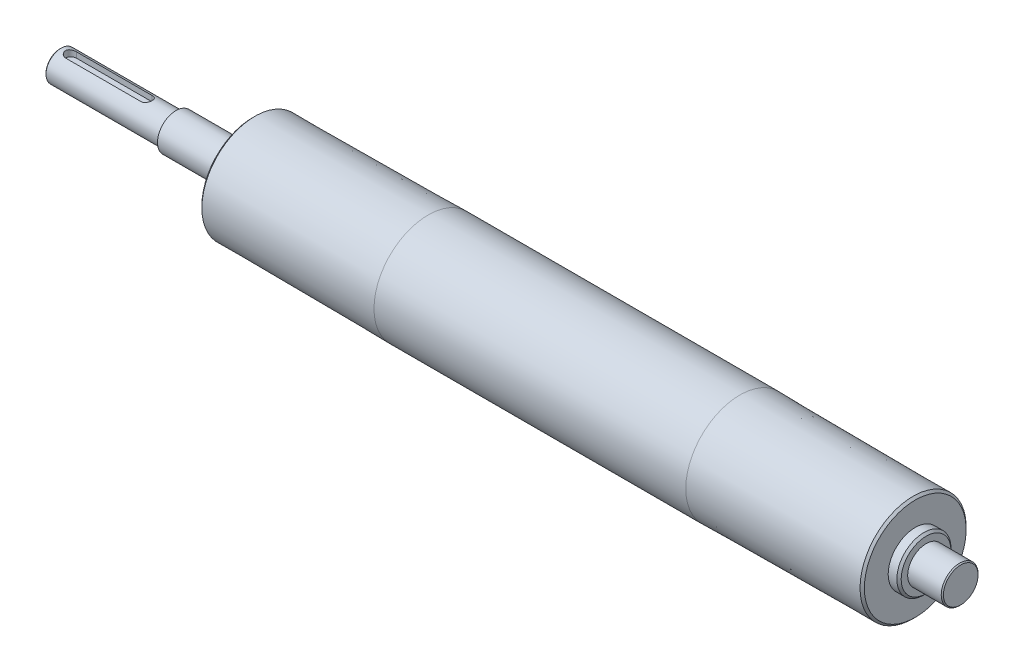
ISO-10303-21;
HEADER;
FILE_DESCRIPTION(('STEP AP214'),'2;1');
FILE_NAME('part.step','',(''),(''),'','','');
FILE_SCHEMA(('AUTOMOTIVE_DESIGN { 1 0 10303 214 1 1 1 1 }'));
ENDSEC;
DATA;
#1=APPLICATION_CONTEXT('core data for automotive mechanical design processes');
#2=APPLICATION_PROTOCOL_DEFINITION('international standard','automotive_design',2000,#1);
#3=PRODUCT_CONTEXT('',#1,'mechanical');
#4=PRODUCT('Part','Part','',(#3));
#5=PRODUCT_RELATED_PRODUCT_CATEGORY('part','',(#4));
#6=PRODUCT_DEFINITION_FORMATION('','',#4);
#7=PRODUCT_DEFINITION_CONTEXT('part definition',#1,'design');
#8=PRODUCT_DEFINITION('design','',#6,#7);
#9=PRODUCT_DEFINITION_SHAPE('','',#8);
#10=(LENGTH_UNIT() NAMED_UNIT(*) SI_UNIT(.MILLI.,.METRE.));
#11=(NAMED_UNIT(*) PLANE_ANGLE_UNIT() SI_UNIT($,.RADIAN.));
#12=(NAMED_UNIT(*) SI_UNIT($,.STERADIAN.) SOLID_ANGLE_UNIT());
#13=UNCERTAINTY_MEASURE_WITH_UNIT(LENGTH_MEASURE(1.E-05),#10,'distance_accuracy_value','');
#14=(GEOMETRIC_REPRESENTATION_CONTEXT(3) GLOBAL_UNCERTAINTY_ASSIGNED_CONTEXT((#13)) GLOBAL_UNIT_ASSIGNED_CONTEXT((#10,
#11,#12)) REPRESENTATION_CONTEXT('',''));
#15=CARTESIAN_POINT('',(0.,0.,0.));
#16=DIRECTION('',(0.,0.,1.));
#17=DIRECTION('',(1.,0.,0.));
#18=AXIS2_PLACEMENT_3D('',#15,#16,#17);
#19=CARTESIAN_POINT('',(-72.,0.,0.));
#20=DIRECTION('',(1.,0.,0.));
#21=DIRECTION('',(0.,0.,-1.));
#22=AXIS2_PLACEMENT_3D('',#19,#20,#21);
#23=CONICAL_SURFACE('',#22,25.,0.00624991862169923);
#24=CARTESIAN_POINT('',(-152.,0.,0.));
#25=DIRECTION('',(-1.,0.,0.));
#26=DIRECTION('',(0.,0.,1.));
#27=AXIS2_PLACEMENT_3D('',#24,#25,#26);
#28=CIRCLE('',#27,24.5);
#29=CARTESIAN_POINT('',(-152.,0.,24.5));
#30=VERTEX_POINT('',#29);
#31=EDGE_CURVE('E160',#30,#30,#28,.T.);
#32=ORIENTED_EDGE('',*,*,#31,.F.);
#33=EDGE_LOOP('',(#32));
#34=FACE_BOUND('',#33,.T.);
#35=CARTESIAN_POINT('',(-72.,0.,0.));
#36=DIRECTION('',(-1.,0.,0.));
#37=DIRECTION('',(0.,0.,1.));
#38=AXIS2_PLACEMENT_3D('',#35,#36,#37);
#39=CIRCLE('',#38,25.);
#40=CARTESIAN_POINT('',(-72.,0.,25.0000000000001));
#41=VERTEX_POINT('',#40);
#42=EDGE_CURVE('E94',#41,#41,#39,.T.);
#43=ORIENTED_EDGE('',*,*,#42,.T.);
#44=EDGE_LOOP('',(#43));
#45=FACE_BOUND('',#44,.T.);
#46=ADVANCED_FACE('F30',(#34,#45),#23,.T.);
#47=CARTESIAN_POINT('',(-152.,0.,0.));
#48=DIRECTION('',(1.,0.,0.));
#49=DIRECTION('',(0.,0.,-1.));
#50=AXIS2_PLACEMENT_3D('',#47,#48,#49);
#51=CONICAL_SURFACE('',#50,24.5,0.785398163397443);
#52=CARTESIAN_POINT('',(-153.,0.,0.));
#53=DIRECTION('',(-1.,0.,0.));
#54=DIRECTION('',(0.,0.,1.));
#55=AXIS2_PLACEMENT_3D('',#52,#53,#54);
#56=CIRCLE('',#55,23.5);
#57=CARTESIAN_POINT('',(-153.,0.,23.5000000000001));
#58=VERTEX_POINT('',#57);
#59=EDGE_CURVE('E157',#58,#58,#56,.T.);
#60=ORIENTED_EDGE('',*,*,#59,.F.);
#61=EDGE_LOOP('',(#60));
#62=FACE_BOUND('',#61,.T.);
#63=ORIENTED_EDGE('',*,*,#31,.T.);
#64=EDGE_LOOP('',(#63));
#65=FACE_BOUND('',#64,.T.);
#66=ADVANCED_FACE('F253',(#62,#65),#51,.T.);
#67=CARTESIAN_POINT('',(-153.,0.,-23.5));
#68=DIRECTION('',(1.,0.,0.));
#69=DIRECTION('',(0.,0.,-1.));
#70=AXIS2_PLACEMENT_3D('',#67,#68,#69);
#71=PLANE('',#70);
#72=CARTESIAN_POINT('',(-153.,0.,0.));
#73=DIRECTION('',(-1.,0.,0.));
#74=DIRECTION('',(0.,0.,1.));
#75=AXIS2_PLACEMENT_3D('',#72,#73,#74);
#76=CIRCLE('',#75,12.5);
#77=CARTESIAN_POINT('',(-153.,0.,12.5000000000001));
#78=VERTEX_POINT('',#77);
#79=EDGE_CURVE('E154',#78,#78,#76,.T.);
#80=ORIENTED_EDGE('',*,*,#79,.F.);
#81=EDGE_LOOP('',(#80));
#82=FACE_BOUND('',#81,.T.);
#83=ORIENTED_EDGE('',*,*,#59,.T.);
#84=EDGE_LOOP('',(#83));
#85=FACE_BOUND('',#84,.T.);
#86=ADVANCED_FACE('F258',(#82,#85),#71,.F.);
#87=CARTESIAN_POINT('',(-226.,0.,0.));
#88=DIRECTION('',(-1.,0.,0.));
#89=DIRECTION('',(0.,0.,1.));
#90=AXIS2_PLACEMENT_3D('',#87,#88,#89);
#91=CYLINDRICAL_SURFACE('',#90,12.5);
#92=CARTESIAN_POINT('',(-157.,0.,0.));
#93=DIRECTION('',(-1.,0.,0.));
#94=DIRECTION('',(0.,0.,1.));
#95=AXIS2_PLACEMENT_3D('',#92,#93,#94);
#96=CIRCLE('',#95,12.5);
#97=CARTESIAN_POINT('',(-157.,0.,12.5000000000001));
#98=VERTEX_POINT('',#97);
#99=EDGE_CURVE('E151',#98,#98,#96,.T.);
#100=ORIENTED_EDGE('',*,*,#99,.F.);
#101=EDGE_LOOP('',(#100));
#102=FACE_BOUND('',#101,.T.);
#103=ORIENTED_EDGE('',*,*,#79,.T.);
#104=EDGE_LOOP('',(#103));
#105=FACE_BOUND('',#104,.T.);
#106=ADVANCED_FACE('F285',(#102,#105),#91,.T.);
#107=CARTESIAN_POINT('',(-157.,0.,0.));
#108=DIRECTION('',(1.,0.,0.));
#109=DIRECTION('',(0.,0.,-1.));
#110=AXIS2_PLACEMENT_3D('',#107,#108,#109);
#111=CONICAL_SURFACE('',#110,12.5,0.785398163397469);
#112=CARTESIAN_POINT('',(-158.,0.,0.));
#113=DIRECTION('',(-1.,0.,0.));
#114=DIRECTION('',(0.,0.,1.));
#115=AXIS2_PLACEMENT_3D('',#112,#113,#114);
#116=CIRCLE('',#115,11.5);
#117=CARTESIAN_POINT('',(-158.,0.,11.5));
#118=VERTEX_POINT('',#117);
#119=EDGE_CURVE('E148',#118,#118,#116,.T.);
#120=ORIENTED_EDGE('',*,*,#119,.F.);
#121=EDGE_LOOP('',(#120));
#122=FACE_BOUND('',#121,.T.);
#123=ORIENTED_EDGE('',*,*,#99,.T.);
#124=EDGE_LOOP('',(#123));
#125=FACE_BOUND('',#124,.T.);
#126=ADVANCED_FACE('F292',(#122,#125),#111,.T.);
#127=CARTESIAN_POINT('',(-158.,0.,-11.4999999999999));
#128=DIRECTION('',(1.,0.,0.));
#129=DIRECTION('',(0.,0.,-1.));
#130=AXIS2_PLACEMENT_3D('',#127,#128,#129);
#131=PLANE('',#130);
#132=CARTESIAN_POINT('',(-158.,0.,0.));
#133=DIRECTION('',(-1.,0.,0.));
#134=DIRECTION('',(0.,0.,1.));
#135=AXIS2_PLACEMENT_3D('',#132,#133,#134);
#136=CIRCLE('',#135,8.50000000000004);
#137=CARTESIAN_POINT('',(-158.,0.,8.50000000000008));
#138=VERTEX_POINT('',#137);
#139=EDGE_CURVE('E145',#138,#138,#136,.T.);
#140=ORIENTED_EDGE('',*,*,#139,.F.);
#141=EDGE_LOOP('',(#140));
#142=FACE_BOUND('',#141,.T.);
#143=ORIENTED_EDGE('',*,*,#119,.T.);
#144=EDGE_LOOP('',(#143));
#145=FACE_BOUND('',#144,.T.);
#146=ADVANCED_FACE('F296',(#142,#145),#131,.F.);
#147=CARTESIAN_POINT('',(-226.,0.,0.));
#148=DIRECTION('',(-1.,0.,0.));
#149=DIRECTION('',(0.,0.,1.));
#150=AXIS2_PLACEMENT_3D('',#147,#148,#149);
#151=CYLINDRICAL_SURFACE('',#150,8.50000000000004);
#152=CARTESIAN_POINT('',(-188.5,0.,0.));
#153=DIRECTION('',(-1.,0.,0.));
#154=DIRECTION('',(0.,0.,1.));
#155=AXIS2_PLACEMENT_3D('',#152,#153,#154);
#156=CIRCLE('',#155,8.50000000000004);
#157=CARTESIAN_POINT('',(-188.5,0.,8.50000000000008));
#158=VERTEX_POINT('',#157);
#159=EDGE_CURVE('E142',#158,#158,#156,.T.);
#160=ORIENTED_EDGE('',*,*,#159,.F.);
#161=EDGE_LOOP('',(#160));
#162=FACE_BOUND('',#161,.T.);
#163=ORIENTED_EDGE('',*,*,#139,.T.);
#164=EDGE_LOOP('',(#163));
#165=FACE_BOUND('',#164,.T.);
#166=ADVANCED_FACE('F300',(#162,#165),#151,.T.);
#167=CARTESIAN_POINT('',(-188.5,0.,-8.5));
#168=DIRECTION('',(1.,0.,0.));
#169=DIRECTION('',(0.,0.,-1.));
#170=AXIS2_PLACEMENT_3D('',#167,#168,#169);
#171=PLANE('',#170);
#172=CARTESIAN_POINT('',(-188.5,0.,0.));
#173=DIRECTION('',(-1.,0.,0.));
#174=DIRECTION('',(0.,0.,1.));
#175=AXIS2_PLACEMENT_3D('',#172,#173,#174);
#176=CIRCLE('',#175,7.00000000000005);
#177=CARTESIAN_POINT('',(-188.5,0.,7.00000000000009));
#178=VERTEX_POINT('',#177);
#179=EDGE_CURVE('E139',#178,#178,#176,.T.);
#180=ORIENTED_EDGE('',*,*,#179,.F.);
#181=EDGE_LOOP('',(#180));
#182=FACE_BOUND('',#181,.T.);
#183=ORIENTED_EDGE('',*,*,#159,.T.);
#184=EDGE_LOOP('',(#183));
#185=FACE_BOUND('',#184,.T.);
#186=ADVANCED_FACE('F248',(#182,#185),#171,.F.);
#187=CARTESIAN_POINT('',(-226.,0.,0.));
#188=DIRECTION('',(-1.,0.,0.));
#189=DIRECTION('',(0.,0.,1.));
#190=AXIS2_PLACEMENT_3D('',#187,#188,#189);
#191=CYLINDRICAL_SURFACE('',#190,7.00000000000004);
#192=DIRECTION('',(-1.,0.,0.));
#193=VECTOR('',#192,1.);
#194=CARTESIAN_POINT('',(-226.,6.53834841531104,2.50000000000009));
#195=LINE('',#194,#193);
#196=CARTESIAN_POINT('',(-237.,6.53834841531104,2.50000000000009));
#197=VERTEX_POINT('',#196);
#198=CARTESIAN_POINT('',(-202.,6.53834841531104,2.50000000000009));
#199=VERTEX_POINT('',#198);
#200=EDGE_CURVE('E11',#197,#199,#195,.F.);
#201=ORIENTED_EDGE('',*,*,#200,.F.);
#202=CARTESIAN_POINT('',(-237.,6.53834841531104,2.50000000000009));
#203=CARTESIAN_POINT('',(-237.067889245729,6.53833653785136,2.50000932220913));
#204=CARTESIAN_POINT('',(-237.135771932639,6.53940549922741,2.49723485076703));
#205=CARTESIAN_POINT('',(-237.271003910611,6.54361657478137,2.48619102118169));
#206=CARTESIAN_POINT('',(-237.338353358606,6.54675805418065,2.47792334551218));
#207=CARTESIAN_POINT('',(-237.471821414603,6.55501217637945,2.45600175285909));
#208=CARTESIAN_POINT('',(-237.53794333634,6.56011831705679,2.44236559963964));
#209=CARTESIAN_POINT('',(-237.668701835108,6.57213177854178,2.40985115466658));
#210=CARTESIAN_POINT('',(-237.733338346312,6.57903917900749,2.39097263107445));
#211=CARTESIAN_POINT('',(-237.924264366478,6.60214934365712,2.32673964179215));
#212=CARTESIAN_POINT('',(-238.047790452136,6.62075475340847,2.27375112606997));
#213=CARTESIAN_POINT('',(-238.284230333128,6.66225397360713,2.14910757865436));
#214=CARTESIAN_POINT('',(-238.397136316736,6.68515090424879,2.07743895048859));
#215=CARTESIAN_POINT('',(-238.614215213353,6.73379913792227,1.91402571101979));
#216=CARTESIAN_POINT('',(-238.717846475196,6.75962864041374,1.82158337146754));
#217=CARTESIAN_POINT('',(-238.908508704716,6.81057592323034,1.62073388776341));
#218=CARTESIAN_POINT('',(-238.995536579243,6.83569357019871,1.51232377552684));
#219=CARTESIAN_POINT('',(-239.153089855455,6.88331133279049,1.27853915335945));
#220=CARTESIAN_POINT('',(-239.223031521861,6.905708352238,1.15274833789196));
#221=CARTESIAN_POINT('',(-239.340536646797,6.94442357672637,0.890250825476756));
#222=CARTESIAN_POINT('',(-239.388107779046,6.96074386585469,0.753547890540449));
#223=CARTESIAN_POINT('',(-239.457640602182,6.98491050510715,0.478829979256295));
#224=CARTESIAN_POINT('',(-239.480539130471,6.99306594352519,0.341079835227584));
#225=CARTESIAN_POINT('',(-239.503068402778,7.00108798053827,0.0634643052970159));
#226=CARTESIAN_POINT('',(-239.502705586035,7.00095687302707,-0.0764004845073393));
#227=CARTESIAN_POINT('',(-239.479288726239,6.99262258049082,-0.34759325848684));
#228=CARTESIAN_POINT('',(-239.457255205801,6.98478243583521,-0.479022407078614));
#229=CARTESIAN_POINT('',(-239.392826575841,6.96237832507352,-0.736175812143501));
#230=CARTESIAN_POINT('',(-239.350430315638,6.94781397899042,-0.861899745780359));
#231=CARTESIAN_POINT('',(-239.245953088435,6.91316506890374,-1.10616102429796));
#232=CARTESIAN_POINT('',(-239.18360428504,6.8930059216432,-1.22457279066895));
#233=CARTESIAN_POINT('',(-239.041220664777,6.84923355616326,-1.44953531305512));
#234=CARTESIAN_POINT('',(-238.961180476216,6.82561928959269,-1.55608245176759));
#235=CARTESIAN_POINT('',(-238.780676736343,6.77590547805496,-1.76032445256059));
#236=CARTESIAN_POINT('',(-238.679350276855,6.74974055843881,-1.85724185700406));
#237=CARTESIAN_POINT('',(-238.461672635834,6.69890342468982,-2.03299914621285));
#238=CARTESIAN_POINT('',(-238.345316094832,6.67423174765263,-2.11183255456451));
#239=CARTESIAN_POINT('',(-238.098057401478,6.62877803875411,-2.25049860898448));
#240=CARTESIAN_POINT('',(-237.966921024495,6.60807875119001,-2.30994207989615));
#241=CARTESIAN_POINT('',(-237.695635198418,6.57388213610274,-2.40555439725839));
#242=CARTESIAN_POINT('',(-237.555500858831,6.5603730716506,-2.44176119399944));
#243=CARTESIAN_POINT('',(-237.344969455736,6.54708542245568,-2.47705497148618));
#244=CARTESIAN_POINT('',(-237.276263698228,6.54382010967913,-2.48565347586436));
#245=CARTESIAN_POINT('',(-237.138384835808,6.53944910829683,-2.49712352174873));
#246=CARTESIAN_POINT('',(-237.0692123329,6.53834103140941,-2.50000139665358));
#247=CARTESIAN_POINT('',(-237.,6.53834841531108,-2.49999999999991));
#248=B_SPLINE_CURVE_WITH_KNOTS('',3,(#202,#203,#204,#205,#206,#207,#208,#209,#210,#211,#212,
#213,#214,#215,#216,#217,#218,#219,#220,#221,#222,#223,#224,#225,#226,#227,#228,#229,#230,#231,
#232,#233,#234,#235,#236,#237,#238,#239,#240,#241,#242,#243,#244,#245,#246,#247),.UNSPECIFIED.,
.F.,.F.,(4,2,2,2,2,2,2,2,2,2,2,2,2,2,2,2,2,2,2,2,2,2,4),(0.,0.203591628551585,0.407120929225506,
0.609982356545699,0.812852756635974,1.21793118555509,1.62330528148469,2.04515972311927,
2.46709267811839,2.90188398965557,3.33652604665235,3.75400993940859,4.17137826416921,
4.56998920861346,4.96862268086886,5.37284909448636,5.7771984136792,6.20315837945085,
6.62927065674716,7.06347329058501,7.49696496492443,7.70468580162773,7.91217653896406),.UNSPECIFIED.);
#249=CARTESIAN_POINT('',(-237.,6.53834841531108,-2.49999999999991));
#250=VERTEX_POINT('',#249);
#251=EDGE_CURVE('E163',#197,#250,#248,.T.);
#252=ORIENTED_EDGE('',*,*,#251,.T.);
#253=DIRECTION('',(-1.,0.,0.));
#254=VECTOR('',#253,1.);
#255=CARTESIAN_POINT('',(-226.,6.53834841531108,-2.49999999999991));
#256=LINE('',#255,#254);
#257=CARTESIAN_POINT('',(-202.,6.53834841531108,-2.49999999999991));
#258=VERTEX_POINT('',#257);
#259=EDGE_CURVE('E37',#250,#258,#256,.F.);
#260=ORIENTED_EDGE('',*,*,#259,.T.);
#261=CARTESIAN_POINT('',(-202.,6.53834841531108,-2.49999999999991));
#262=CARTESIAN_POINT('',(-201.932110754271,6.53833653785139,-2.50000932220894));
#263=CARTESIAN_POINT('',(-201.864228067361,6.53940549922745,-2.49723485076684));
#264=CARTESIAN_POINT('',(-201.728996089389,6.5436165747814,-2.4861910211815));
#265=CARTESIAN_POINT('',(-201.661646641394,6.54675805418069,-2.47792334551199));
#266=CARTESIAN_POINT('',(-201.528178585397,6.55501217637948,-2.4560017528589));
#267=CARTESIAN_POINT('',(-201.46205666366,6.56011831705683,-2.44236559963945));
#268=CARTESIAN_POINT('',(-201.331298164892,6.57213177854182,-2.40985115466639));
#269=CARTESIAN_POINT('',(-201.266661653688,6.57903917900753,-2.39097263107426));
#270=CARTESIAN_POINT('',(-201.075735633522,6.60214934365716,-2.32673964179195));
#271=CARTESIAN_POINT('',(-200.952209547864,6.62075475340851,-2.27375112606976));
#272=CARTESIAN_POINT('',(-200.715769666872,6.66225397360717,-2.14910757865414));
#273=CARTESIAN_POINT('',(-200.602863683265,6.68515090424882,-2.07743895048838));
#274=CARTESIAN_POINT('',(-200.385784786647,6.7337991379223,-1.91402571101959));
#275=CARTESIAN_POINT('',(-200.282153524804,6.75962864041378,-1.82158337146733));
#276=CARTESIAN_POINT('',(-200.091491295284,6.81057592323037,-1.6207338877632));
#277=CARTESIAN_POINT('',(-200.004463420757,6.83569357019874,-1.51232377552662));
#278=CARTESIAN_POINT('',(-199.846910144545,6.88331133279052,-1.27853915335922));
#279=CARTESIAN_POINT('',(-199.77696847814,6.90570835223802,-1.15274833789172));
#280=CARTESIAN_POINT('',(-199.659463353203,6.94442357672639,-0.890250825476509));
#281=CARTESIAN_POINT('',(-199.611892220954,6.96074386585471,-0.753547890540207));
#282=CARTESIAN_POINT('',(-199.542359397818,6.98491050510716,-0.478829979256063));
#283=CARTESIAN_POINT('',(-199.519460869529,6.9930659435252,-0.341079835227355));
#284=CARTESIAN_POINT('',(-199.496931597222,7.00108798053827,-0.063464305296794));
#285=CARTESIAN_POINT('',(-199.497294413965,7.00095687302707,0.0764004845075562));
#286=CARTESIAN_POINT('',(-199.520711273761,6.99262258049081,0.347593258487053));
#287=CARTESIAN_POINT('',(-199.542744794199,6.9847824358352,0.479022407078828));
#288=CARTESIAN_POINT('',(-199.607173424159,6.96237832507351,0.736175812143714));
#289=CARTESIAN_POINT('',(-199.649569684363,6.94781397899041,0.861899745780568));
#290=CARTESIAN_POINT('',(-199.754046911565,6.91316506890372,1.10616102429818));
#291=CARTESIAN_POINT('',(-199.81639571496,6.89300592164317,1.22457279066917));
#292=CARTESIAN_POINT('',(-199.958779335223,6.84923355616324,1.44953531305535));
#293=CARTESIAN_POINT('',(-200.038819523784,6.82561928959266,1.55608245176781));
#294=CARTESIAN_POINT('',(-200.219323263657,6.77590547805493,1.76032445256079));
#295=CARTESIAN_POINT('',(-200.320649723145,6.74974055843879,1.85724185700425));
#296=CARTESIAN_POINT('',(-200.538327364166,6.69890342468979,2.03299914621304));
#297=CARTESIAN_POINT('',(-200.654683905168,6.6742317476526,2.11183255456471));
#298=CARTESIAN_POINT('',(-200.901942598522,6.62877803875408,2.25049860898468));
#299=CARTESIAN_POINT('',(-201.033078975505,6.60807875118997,2.30994207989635));
#300=CARTESIAN_POINT('',(-201.304364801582,6.5738821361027,2.40555439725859));
#301=CARTESIAN_POINT('',(-201.444499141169,6.56037307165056,2.44176119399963));
#302=CARTESIAN_POINT('',(-201.655030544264,6.54708542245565,2.47705497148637));
#303=CARTESIAN_POINT('',(-201.723736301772,6.5438201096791,2.48565347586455));
#304=CARTESIAN_POINT('',(-201.861615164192,6.53944910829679,2.49712352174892));
#305=CARTESIAN_POINT('',(-201.930787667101,6.53834103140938,2.50000139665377));
#306=CARTESIAN_POINT('',(-202.,6.53834841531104,2.50000000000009));
#307=B_SPLINE_CURVE_WITH_KNOTS('',3,(#261,#262,#263,#264,#265,#266,#267,#268,#269,#270,#271,
#272,#273,#274,#275,#276,#277,#278,#279,#280,#281,#282,#283,#284,#285,#286,#287,#288,#289,#290,
#291,#292,#293,#294,#295,#296,#297,#298,#299,#300,#301,#302,#303,#304,#305,#306),.UNSPECIFIED.,
.F.,.F.,(4,2,2,2,2,2,2,2,2,2,2,2,2,2,2,2,2,2,2,2,2,2,4),(0.,0.203591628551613,0.407120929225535,
0.609982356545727,0.812852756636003,1.21793118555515,1.62330528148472,2.04515972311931,
2.46709267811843,2.90188398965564,3.33652604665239,3.75400993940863,4.17137826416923,
4.56998920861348,4.96862268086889,5.37284909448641,5.77719841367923,6.20315837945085,
6.62927065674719,7.06347329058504,7.49696496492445,7.70468580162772,7.91217653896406),.UNSPECIFIED.);
#308=EDGE_CURVE('E44',#258,#199,#307,.T.);
#309=ORIENTED_EDGE('',*,*,#308,.T.);
#310=EDGE_LOOP('',(#201,#252,#260,#309));
#311=FACE_BOUND('',#310,.T.);
#312=CARTESIAN_POINT('',(-241.5,0.,0.));
#313=DIRECTION('',(-1.,0.,0.));
#314=DIRECTION('',(0.,0.,1.));
#315=AXIS2_PLACEMENT_3D('',#312,#313,#314);
#316=CIRCLE('',#315,7.00000000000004);
#317=CARTESIAN_POINT('',(-241.5,0.,7.00000000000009));
#318=VERTEX_POINT('',#317);
#319=EDGE_CURVE('E136',#318,#318,#316,.T.);
#320=ORIENTED_EDGE('',*,*,#319,.F.);
#321=EDGE_LOOP('',(#320));
#322=FACE_BOUND('',#321,.T.);
#323=ORIENTED_EDGE('',*,*,#179,.T.);
#324=EDGE_LOOP('',(#323));
#325=FACE_BOUND('',#324,.T.);
#326=ADVANCED_FACE('F175',(#311,#322,#325),#191,.T.);
#327=CARTESIAN_POINT('',(-241.5,0.,0.));
#328=DIRECTION('',(1.,0.,0.));
#329=DIRECTION('',(0.,0.,-1.));
#330=AXIS2_PLACEMENT_3D('',#327,#328,#329);
#331=CONICAL_SURFACE('',#330,7.00000000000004,0.785398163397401);
#332=CARTESIAN_POINT('',(-242.,0.,0.));
#333=DIRECTION('',(-1.,0.,0.));
#334=DIRECTION('',(0.,0.,1.));
#335=AXIS2_PLACEMENT_3D('',#332,#333,#334);
#336=CIRCLE('',#335,6.50000000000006);
#337=CARTESIAN_POINT('',(-242.,0.,6.50000000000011));
#338=VERTEX_POINT('',#337);
#339=EDGE_CURVE('E133',#338,#338,#336,.T.);
#340=ORIENTED_EDGE('',*,*,#339,.F.);
#341=EDGE_LOOP('',(#340));
#342=FACE_BOUND('',#341,.T.);
#343=ORIENTED_EDGE('',*,*,#319,.T.);
#344=EDGE_LOOP('',(#343));
#345=FACE_BOUND('',#344,.T.);
#346=ADVANCED_FACE('F241',(#342,#345),#331,.T.);
#347=CARTESIAN_POINT('',(-242.,0.,-6.50000000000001));
#348=DIRECTION('',(1.,0.,0.));
#349=DIRECTION('',(0.,0.,-1.));
#350=AXIS2_PLACEMENT_3D('',#347,#348,#349);
#351=PLANE('',#350);
#352=CARTESIAN_POINT('',(-242.,0.,0.));
#353=DIRECTION('',(-1.,0.,0.));
#354=DIRECTION('',(0.,0.,1.));
#355=AXIS2_PLACEMENT_3D('',#352,#353,#354);
#356=CIRCLE('',#355,3.00000000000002);
#357=CARTESIAN_POINT('',(-242.,0.,3.00000000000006));
#358=VERTEX_POINT('',#357);
#359=EDGE_CURVE('E130',#358,#358,#356,.T.);
#360=ORIENTED_EDGE('',*,*,#359,.F.);
#361=EDGE_LOOP('',(#360));
#362=FACE_BOUND('',#361,.T.);
#363=ORIENTED_EDGE('',*,*,#339,.T.);
#364=EDGE_LOOP('',(#363));
#365=FACE_BOUND('',#364,.T.);
#366=ADVANCED_FACE('F238',(#362,#365),#351,.F.);
#367=CARTESIAN_POINT('',(-226.,0.,0.));
#368=DIRECTION('',(-1.,0.,0.));
#369=DIRECTION('',(0.,0.,1.));
#370=AXIS2_PLACEMENT_3D('',#367,#368,#369);
#371=CYLINDRICAL_SURFACE('',#370,3.00000000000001);
#372=CARTESIAN_POINT('',(-226.,0.,0.));
#373=DIRECTION('',(-1.,0.,0.));
#374=DIRECTION('',(0.,0.,1.));
#375=AXIS2_PLACEMENT_3D('',#372,#373,#374);
#376=CIRCLE('',#375,3.00000000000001);
#377=CARTESIAN_POINT('',(-226.,0.,3.00000000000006));
#378=VERTEX_POINT('',#377);
#379=EDGE_CURVE('E127',#378,#378,#376,.T.);
#380=ORIENTED_EDGE('',*,*,#379,.F.);
#381=EDGE_LOOP('',(#380));
#382=FACE_BOUND('',#381,.T.);
#383=ORIENTED_EDGE('',*,*,#359,.T.);
#384=EDGE_LOOP('',(#383));
#385=FACE_BOUND('',#384,.T.);
#386=ADVANCED_FACE('F234',(#382,#385),#371,.F.);
#387=CARTESIAN_POINT('',(-226.,0.,-2.99999999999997));
#388=DIRECTION('',(1.,0.,0.));
#389=DIRECTION('',(0.,0.,-1.));
#390=AXIS2_PLACEMENT_3D('',#387,#388,#389);
#391=PLANE('',#390);
#392=ORIENTED_EDGE('',*,*,#379,.T.);
#393=EDGE_LOOP('',(#392));
#394=FACE_BOUND('',#393,.T.);
#395=ADVANCED_FACE('F230',(#394),#391,.F.);
#396=CARTESIAN_POINT('',(174.,0.,-8.));
#397=DIRECTION('',(-1.,0.,0.));
#398=DIRECTION('',(0.,0.,1.));
#399=AXIS2_PLACEMENT_3D('',#396,#397,#398);
#400=PLANE('',#399);
#401=CARTESIAN_POINT('',(174.,0.,0.));
#402=DIRECTION('',(-1.,0.,0.));
#403=DIRECTION('',(0.,0.,1.));
#404=AXIS2_PLACEMENT_3D('',#401,#402,#403);
#405=CIRCLE('',#404,8.);
#406=CARTESIAN_POINT('',(174.,0.,8.));
#407=VERTEX_POINT('',#406);
#408=EDGE_CURVE('E124',#407,#407,#405,.T.);
#409=ORIENTED_EDGE('',*,*,#408,.F.);
#410=EDGE_LOOP('',(#409));
#411=FACE_BOUND('',#410,.T.);
#412=ADVANCED_FACE('F226',(#411),#400,.F.);
#413=CARTESIAN_POINT('',(174.,0.,0.));
#414=DIRECTION('',(-1.,0.,0.));
#415=DIRECTION('',(0.,0.,1.));
#416=AXIS2_PLACEMENT_3D('',#413,#414,#415);
#417=CONICAL_SURFACE('',#416,8.,0.78539816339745);
#418=CARTESIAN_POINT('',(173.5,0.,0.));
#419=DIRECTION('',(-1.,0.,0.));
#420=DIRECTION('',(0.,0.,1.));
#421=AXIS2_PLACEMENT_3D('',#418,#419,#420);
#422=CIRCLE('',#421,8.5);
#423=CARTESIAN_POINT('',(173.5,0.,8.5));
#424=VERTEX_POINT('',#423);
#425=EDGE_CURVE('E121',#424,#424,#422,.T.);
#426=ORIENTED_EDGE('',*,*,#425,.F.);
#427=EDGE_LOOP('',(#426));
#428=FACE_BOUND('',#427,.T.);
#429=ORIENTED_EDGE('',*,*,#408,.T.);
#430=EDGE_LOOP('',(#429));
#431=FACE_BOUND('',#430,.T.);
#432=ADVANCED_FACE('F222',(#428,#431),#417,.T.);
#433=CARTESIAN_POINT('',(-226.,0.,0.));
#434=DIRECTION('',(-1.,0.,0.));
#435=DIRECTION('',(0.,0.,1.));
#436=AXIS2_PLACEMENT_3D('',#433,#434,#435);
#437=CYLINDRICAL_SURFACE('',#436,8.5);
#438=CARTESIAN_POINT('',(158.,0.,0.));
#439=DIRECTION('',(-1.,0.,0.));
#440=DIRECTION('',(0.,0.,1.));
#441=AXIS2_PLACEMENT_3D('',#438,#439,#440);
#442=CIRCLE('',#441,8.5);
#443=CARTESIAN_POINT('',(158.,0.,8.5));
#444=VERTEX_POINT('',#443);
#445=EDGE_CURVE('E118',#444,#444,#442,.T.);
#446=ORIENTED_EDGE('',*,*,#445,.F.);
#447=EDGE_LOOP('',(#446));
#448=FACE_BOUND('',#447,.T.);
#449=ORIENTED_EDGE('',*,*,#425,.T.);
#450=EDGE_LOOP('',(#449));
#451=FACE_BOUND('',#450,.T.);
#452=ADVANCED_FACE('F218',(#448,#451),#437,.T.);
#453=CARTESIAN_POINT('',(158.,0.,-11.5));
#454=DIRECTION('',(-1.,0.,0.));
#455=DIRECTION('',(0.,0.,1.));
#456=AXIS2_PLACEMENT_3D('',#453,#454,#455);
#457=PLANE('',#456);
#458=CARTESIAN_POINT('',(158.,0.,0.));
#459=DIRECTION('',(-1.,0.,0.));
#460=DIRECTION('',(0.,0.,1.));
#461=AXIS2_PLACEMENT_3D('',#458,#459,#460);
#462=CIRCLE('',#461,11.5);
#463=CARTESIAN_POINT('',(158.,0.,11.5));
#464=VERTEX_POINT('',#463);
#465=EDGE_CURVE('E115',#464,#464,#462,.T.);
#466=ORIENTED_EDGE('',*,*,#465,.F.);
#467=EDGE_LOOP('',(#466));
#468=FACE_BOUND('',#467,.T.);
#469=ORIENTED_EDGE('',*,*,#445,.T.);
#470=EDGE_LOOP('',(#469));
#471=FACE_BOUND('',#470,.T.);
#472=ADVANCED_FACE('F214',(#468,#471),#457,.F.);
#473=CARTESIAN_POINT('',(158.,0.,0.));
#474=DIRECTION('',(-1.,0.,0.));
#475=DIRECTION('',(0.,0.,1.));
#476=AXIS2_PLACEMENT_3D('',#473,#474,#475);
#477=CONICAL_SURFACE('',#476,11.5,0.78539816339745);
#478=CARTESIAN_POINT('',(157.,0.,0.));
#479=DIRECTION('',(-1.,0.,0.));
#480=DIRECTION('',(0.,0.,1.));
#481=AXIS2_PLACEMENT_3D('',#478,#479,#480);
#482=CIRCLE('',#481,12.5);
#483=CARTESIAN_POINT('',(157.,0.,12.5));
#484=VERTEX_POINT('',#483);
#485=EDGE_CURVE('E112',#484,#484,#482,.T.);
#486=ORIENTED_EDGE('',*,*,#485,.F.);
#487=EDGE_LOOP('',(#486));
#488=FACE_BOUND('',#487,.T.);
#489=ORIENTED_EDGE('',*,*,#465,.T.);
#490=EDGE_LOOP('',(#489));
#491=FACE_BOUND('',#490,.T.);
#492=ADVANCED_FACE('F210',(#488,#491),#477,.T.);
#493=CARTESIAN_POINT('',(-226.,0.,0.));
#494=DIRECTION('',(-1.,0.,0.));
#495=DIRECTION('',(0.,0.,1.));
#496=AXIS2_PLACEMENT_3D('',#493,#494,#495);
#497=CYLINDRICAL_SURFACE('',#496,12.5);
#498=CARTESIAN_POINT('',(153.,0.,0.));
#499=DIRECTION('',(-1.,0.,0.));
#500=DIRECTION('',(0.,0.,1.));
#501=AXIS2_PLACEMENT_3D('',#498,#499,#500);
#502=CIRCLE('',#501,12.5);
#503=CARTESIAN_POINT('',(153.,0.,12.5));
#504=VERTEX_POINT('',#503);
#505=EDGE_CURVE('E109',#504,#504,#502,.T.);
#506=ORIENTED_EDGE('',*,*,#505,.F.);
#507=EDGE_LOOP('',(#506));
#508=FACE_BOUND('',#507,.T.);
#509=ORIENTED_EDGE('',*,*,#485,.T.);
#510=EDGE_LOOP('',(#509));
#511=FACE_BOUND('',#510,.T.);
#512=ADVANCED_FACE('F206',(#508,#511),#497,.T.);
#513=CARTESIAN_POINT('',(153.,0.,-23.5));
#514=DIRECTION('',(-1.,0.,0.));
#515=DIRECTION('',(0.,0.,1.));
#516=AXIS2_PLACEMENT_3D('',#513,#514,#515);
#517=PLANE('',#516);
#518=CARTESIAN_POINT('',(153.,0.,0.));
#519=DIRECTION('',(-1.,0.,0.));
#520=DIRECTION('',(0.,0.,1.));
#521=AXIS2_PLACEMENT_3D('',#518,#519,#520);
#522=CIRCLE('',#521,23.5);
#523=CARTESIAN_POINT('',(153.,0.,23.5));
#524=VERTEX_POINT('',#523);
#525=EDGE_CURVE('E106',#524,#524,#522,.T.);
#526=ORIENTED_EDGE('',*,*,#525,.F.);
#527=EDGE_LOOP('',(#526));
#528=FACE_BOUND('',#527,.T.);
#529=ORIENTED_EDGE('',*,*,#505,.T.);
#530=EDGE_LOOP('',(#529));
#531=FACE_BOUND('',#530,.T.);
#532=ADVANCED_FACE('F202',(#528,#531),#517,.F.);
#533=CARTESIAN_POINT('',(153.,0.,0.));
#534=DIRECTION('',(-1.,0.,0.));
#535=DIRECTION('',(0.,0.,1.));
#536=AXIS2_PLACEMENT_3D('',#533,#534,#535);
#537=CONICAL_SURFACE('',#536,23.5,0.78539816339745);
#538=CARTESIAN_POINT('',(152.,0.,0.));
#539=DIRECTION('',(-1.,0.,0.));
#540=DIRECTION('',(0.,0.,1.));
#541=AXIS2_PLACEMENT_3D('',#538,#539,#540);
#542=CIRCLE('',#541,24.5);
#543=CARTESIAN_POINT('',(152.,0.,24.5));
#544=VERTEX_POINT('',#543);
#545=EDGE_CURVE('E103',#544,#544,#542,.T.);
#546=ORIENTED_EDGE('',*,*,#545,.F.);
#547=EDGE_LOOP('',(#546));
#548=FACE_BOUND('',#547,.T.);
#549=ORIENTED_EDGE('',*,*,#525,.T.);
#550=EDGE_LOOP('',(#549));
#551=FACE_BOUND('',#550,.T.);
#552=ADVANCED_FACE('F198',(#548,#551),#537,.T.);
#553=CARTESIAN_POINT('',(152.,0.,0.));
#554=DIRECTION('',(-1.,0.,0.));
#555=DIRECTION('',(0.,0.,1.));
#556=AXIS2_PLACEMENT_3D('',#553,#554,#555);
#557=CONICAL_SURFACE('',#556,24.5,0.00624991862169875);
#558=CARTESIAN_POINT('',(72.,0.,0.));
#559=DIRECTION('',(-1.,0.,0.));
#560=DIRECTION('',(0.,0.,1.));
#561=AXIS2_PLACEMENT_3D('',#558,#559,#560);
#562=CIRCLE('',#561,25.);
#563=CARTESIAN_POINT('',(72.,0.,25.));
#564=VERTEX_POINT('',#563);
#565=EDGE_CURVE('E100',#564,#564,#562,.T.);
#566=ORIENTED_EDGE('',*,*,#565,.F.);
#567=EDGE_LOOP('',(#566));
#568=FACE_BOUND('',#567,.T.);
#569=ORIENTED_EDGE('',*,*,#545,.T.);
#570=EDGE_LOOP('',(#569));
#571=FACE_BOUND('',#570,.T.);
#572=ADVANCED_FACE('F194',(#568,#571),#557,.T.);
#573=CARTESIAN_POINT('',(-226.,0.,0.));
#574=DIRECTION('',(-1.,0.,0.));
#575=DIRECTION('',(0.,0.,1.));
#576=AXIS2_PLACEMENT_3D('',#573,#574,#575);
#577=CYLINDRICAL_SURFACE('',#576,25.);
#578=ORIENTED_EDGE('',*,*,#42,.F.);
#579=EDGE_LOOP('',(#578));
#580=FACE_BOUND('',#579,.T.);
#581=ORIENTED_EDGE('',*,*,#565,.T.);
#582=EDGE_LOOP('',(#581));
#583=FACE_BOUND('',#582,.T.);
#584=ADVANCED_FACE('F191',(#580,#583),#577,.T.);
#585=CARTESIAN_POINT('',(-202.,4.,0.));
#586=DIRECTION('',(0.,1.,0.));
#587=DIRECTION('',(0.,0.,1.));
#588=AXIS2_PLACEMENT_3D('',#585,#586,#587);
#589=CYLINDRICAL_SURFACE('',#588,2.5);
#590=DIRECTION('',(0.,1.,0.));
#591=VECTOR('',#590,1.);
#592=CARTESIAN_POINT('',(-202.,4.,-2.49999999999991));
#593=LINE('',#592,#591);
#594=CARTESIAN_POINT('',(-202.,4.,-2.49999999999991));
#595=VERTEX_POINT('',#594);
#596=EDGE_CURVE('E67',#595,#258,#593,.T.);
#597=ORIENTED_EDGE('',*,*,#596,.F.);
#598=CARTESIAN_POINT('',(-202.,4.,0.));
#599=DIRECTION('',(0.,1.,0.));
#600=DIRECTION('',(-1.,0.,0.));
#601=AXIS2_PLACEMENT_3D('',#598,#599,#600);
#602=CIRCLE('',#601,2.5);
#603=CARTESIAN_POINT('',(-202.,4.,2.50000000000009));
#604=VERTEX_POINT('',#603);
#605=EDGE_CURVE('E71',#604,#595,#602,.T.);
#606=ORIENTED_EDGE('',*,*,#605,.F.);
#607=DIRECTION('',(0.,1.,0.));
#608=VECTOR('',#607,1.);
#609=CARTESIAN_POINT('',(-202.,4.,2.50000000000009));
#610=LINE('',#609,#608);
#611=EDGE_CURVE('E92',#604,#199,#610,.T.);
#612=ORIENTED_EDGE('',*,*,#611,.T.);
#613=ORIENTED_EDGE('',*,*,#308,.F.);
#614=EDGE_LOOP('',(#597,#606,#612,#613));
#615=FACE_BOUND('',#614,.T.);
#616=ADVANCED_FACE('F69',(#615),#589,.F.);
#617=CARTESIAN_POINT('',(-202.,4.,2.50000000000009));
#618=DIRECTION('',(0.,0.,-1.));
#619=DIRECTION('',(-1.,0.,0.));
#620=AXIS2_PLACEMENT_3D('',#617,#618,#619);
#621=PLANE('',#620);
#622=ORIENTED_EDGE('',*,*,#200,.T.);
#623=ORIENTED_EDGE('',*,*,#611,.F.);
#624=DIRECTION('',(-1.,0.,0.));
#625=VECTOR('',#624,1.);
#626=CARTESIAN_POINT('',(-202.,4.,2.50000000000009));
#627=LINE('',#626,#625);
#628=CARTESIAN_POINT('',(-237.,4.,2.50000000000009));
#629=VERTEX_POINT('',#628);
#630=EDGE_CURVE('E75',#604,#629,#627,.T.);
#631=ORIENTED_EDGE('',*,*,#630,.T.);
#632=DIRECTION('',(0.,1.,0.));
#633=VECTOR('',#632,1.);
#634=CARTESIAN_POINT('',(-237.,4.,2.50000000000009));
#635=LINE('',#634,#633);
#636=EDGE_CURVE('E95',#629,#197,#635,.T.);
#637=ORIENTED_EDGE('',*,*,#636,.T.);
#638=EDGE_LOOP('',(#622,#623,#631,#637));
#639=FACE_BOUND('',#638,.T.);
#640=ADVANCED_FACE('F184',(#639),#621,.T.);
#641=CARTESIAN_POINT('',(-237.,4.,0.));
#642=DIRECTION('',(0.,1.,0.));
#643=DIRECTION('',(0.,0.,1.));
#644=AXIS2_PLACEMENT_3D('',#641,#642,#643);
#645=CYLINDRICAL_SURFACE('',#644,2.5);
#646=ORIENTED_EDGE('',*,*,#636,.F.);
#647=CARTESIAN_POINT('',(-237.,4.,0.));
#648=DIRECTION('',(0.,1.,0.));
#649=DIRECTION('',(-1.,0.,0.));
#650=AXIS2_PLACEMENT_3D('',#647,#648,#649);
#651=CIRCLE('',#650,2.5);
#652=CARTESIAN_POINT('',(-237.,4.,-2.49999999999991));
#653=VERTEX_POINT('',#652);
#654=EDGE_CURVE('E84',#653,#629,#651,.T.);
#655=ORIENTED_EDGE('',*,*,#654,.F.);
#656=DIRECTION('',(0.,1.,0.));
#657=VECTOR('',#656,1.);
#658=CARTESIAN_POINT('',(-237.,4.,-2.49999999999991));
#659=LINE('',#658,#657);
#660=EDGE_CURVE('E74',#653,#250,#659,.T.);
#661=ORIENTED_EDGE('',*,*,#660,.T.);
#662=ORIENTED_EDGE('',*,*,#251,.F.);
#663=EDGE_LOOP('',(#646,#655,#661,#662));
#664=FACE_BOUND('',#663,.T.);
#665=ADVANCED_FACE('F179',(#664),#645,.F.);
#666=CARTESIAN_POINT('',(-202.,4.,-2.49999999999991));
#667=DIRECTION('',(0.,0.,-1.));
#668=DIRECTION('',(-1.,0.,0.));
#669=AXIS2_PLACEMENT_3D('',#666,#667,#668);
#670=PLANE('',#669);
#671=ORIENTED_EDGE('',*,*,#660,.F.);
#672=DIRECTION('',(-1.,0.,0.));
#673=VECTOR('',#672,1.);
#674=CARTESIAN_POINT('',(-202.,4.,-2.49999999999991));
#675=LINE('',#674,#673);
#676=EDGE_CURVE('E78',#595,#653,#675,.T.);
#677=ORIENTED_EDGE('',*,*,#676,.F.);
#678=ORIENTED_EDGE('',*,*,#596,.T.);
#679=ORIENTED_EDGE('',*,*,#259,.F.);
#680=EDGE_LOOP('',(#671,#677,#678,#679));
#681=FACE_BOUND('',#680,.T.);
#682=ADVANCED_FACE('F79',(#681),#670,.F.);
#683=CARTESIAN_POINT('',(-202.,4.,0.));
#684=DIRECTION('',(0.,1.,0.));
#685=DIRECTION('',(-1.,0.,0.));
#686=AXIS2_PLACEMENT_3D('',#683,#684,#685);
#687=PLANE('',#686);
#688=ORIENTED_EDGE('',*,*,#605,.T.);
#689=ORIENTED_EDGE('',*,*,#676,.T.);
#690=ORIENTED_EDGE('',*,*,#654,.T.);
#691=ORIENTED_EDGE('',*,*,#630,.F.);
#692=EDGE_LOOP('',(#688,#689,#690,#691));
#693=FACE_BOUND('',#692,.T.);
#694=ADVANCED_FACE('F87',(#693),#687,.T.);
#695=CLOSED_SHELL('',(#46,#66,#86,#106,#126,#146,#166,#186,#326,#346,#366,#386,#395,#412,#432,
#452,#472,#492,#512,#532,#552,#572,#584,#616,#640,#665,#682,#694));
#696=MANIFOLD_SOLID_BREP('B2',#695);
#697=ADVANCED_BREP_SHAPE_REPRESENTATION('',(#18,#696),#14);
#698=SHAPE_DEFINITION_REPRESENTATION(#9,#697);
ENDSEC;
END-ISO-10303-21;
